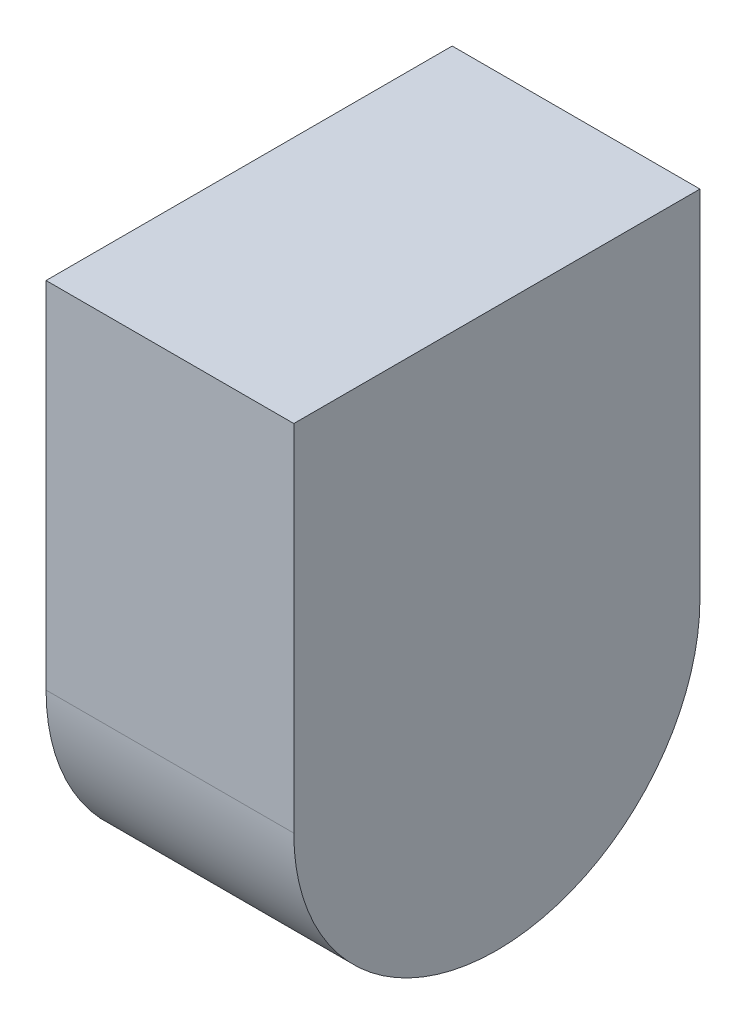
from build123d import *

# Parameters (mm, degrees)
EXTRUDE_1_DEPTH = 1
EXTRUDE_2_DEPTH = 14.6
EXTRUDE_3_DEPTH = 6
EXTRUDE_4_DEPTH = 2.5
EXTRUDE_6_DEPTH = 2.7


with BuildPart() as part:
    # Sketch 1 → Extrude 1 (new body)
    with BuildSketch(Plane(origin=(0, 0, 0), x_dir=(0, 0, -1), z_dir=(1, 0, 0))):
        with BuildLine():
            Line((15, 0), (15, 26.2))
            Line((15, 26.2), (-15, 26.2))
            Line((-15, 26.2), (-15, 0))
            ThreePointArc((-15, 0), (0, -15), (15, 0))
        make_face()
    extrude(amount=EXTRUDE_1_DEPTH)

    # Sketch 2 → Extrude 2 (add)
    with BuildSketch(Plane(origin=(1, 0, 0), x_dir=(0, 0, -1), z_dir=(1, 0, 0))):
        with BuildLine():
            Line((15, 0), (15, 26.2))
            Line((15, 26.2), (-15, 26.2))
            Line((-15, 26.2), (-15, 0))
            ThreePointArc((-15, 0), (0, -15), (15, 0))
        make_face()
        with BuildLine():
            Line((14, 0), (14, 25.2))
            Line((14, 25.2), (-14, 25.2))
            Line((-14, 25.2), (-14, 0))
            ThreePointArc((-14, 0), (0, -14), (14, 0))
        make_face(mode=Mode.SUBTRACT)
    extrude(amount=EXTRUDE_2_DEPTH)

    # Sketch 4 → Extrude 3 (add)
    with BuildSketch(Plane(origin=(3.6, 0, 0), x_dir=(0, 0, -1), z_dir=(1, 0, 0))):
        Polygon((8.5, 8.7), (14, 14.2), (14, 20.2), (-14, 20.2), (-14, 14.2), (-8.5, 8.7), align=None)
    extrude(amount=EXTRUDE_3_DEPTH)

    # Sketch 5 → Extrude 4 (add)
    with BuildSketch(Plane(origin=(14.6, 0, 0), x_dir=(0, 0, -1), z_dir=(1, 0, 0))):
        Polygon((14, 14.2), (14, 20.2), (-14, 20.2), (-14, 14.2), (-8.5, 8.7), (8.5, 8.7), align=None)
    extrude(amount=-EXTRUDE_4_DEPTH)

    # Sketch 6 → Extrude 6 (add)
    with BuildSketch(Plane(origin=(15.6, 0, 0), x_dir=(0, 0, -1), z_dir=(1, 0, 0))):
        with BuildLine():
            Line((-15, 0), (-15, 26.2))
            Line((-15, 26.2), (15, 26.2))
            Line((15, 26.2), (15, 0))
            ThreePointArc((15, 0), (0, -15), (-15, 0))
        make_face()
    extrude(amount=EXTRUDE_6_DEPTH)


solid = part.part
